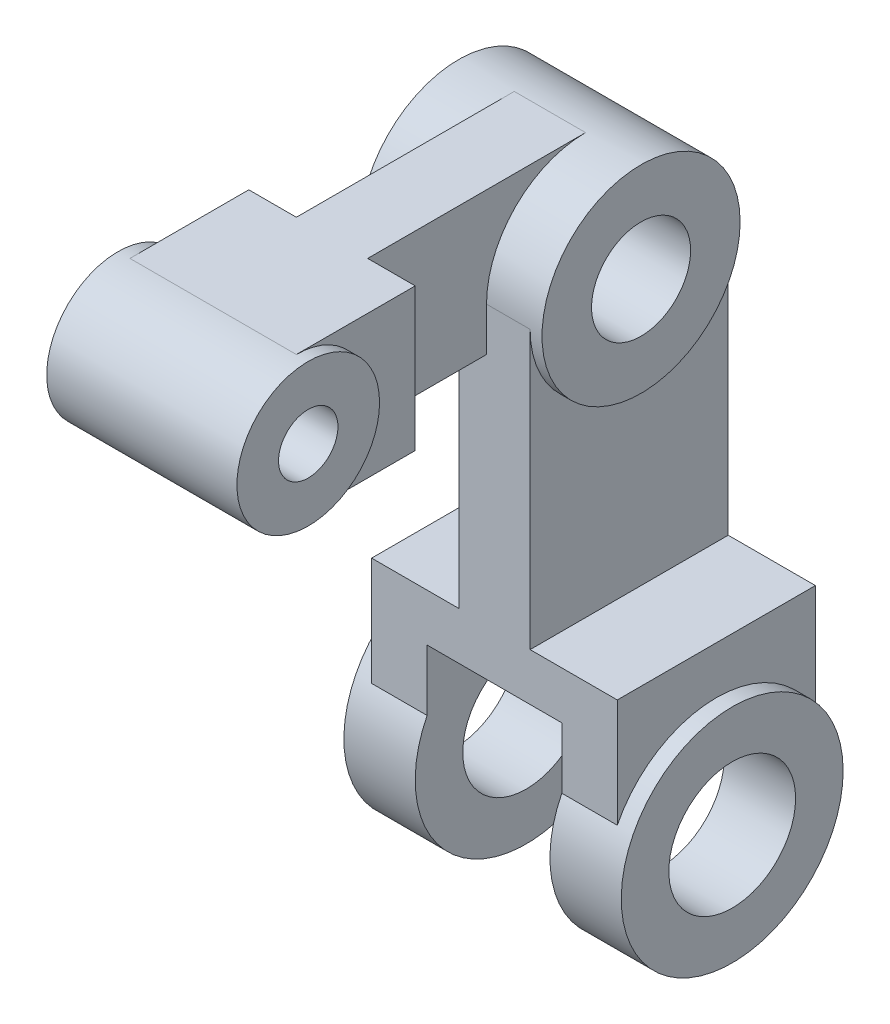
from build123d import *

# Parameters (mm, degrees)
SKETCH1_R                = 28
SKETCH1_R_2              = 16
BOSS_EXTRUDE1_DEPTH      = 35
BOSS_EXTRUDE2_DEPTH      = 31
BOSS_EXTRUDE3_DEPTH      = 9
BOSS_EXTRUDE4_DEPTH      = 12
BOSS_EXTRUDE4_DEPTH_BACK = 34
SKETCH3_10_R             = 25
SKETCH3_10_R_2           = 12.5
CUT_EXTRUDE1_DEPTH       = 143.246265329
CUT_EXTRUDE1_DEPTH_BACK  = 143.246265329
SKETCH5_W                = 34
SKETCH5_H                = 56
BOSS_EXTRUDE5_REACH      = 164.293
SKETCH7_W                = 18
SKETCH7_H                = 36
BOSS_EXTRUDE6_DEPTH      = 21
SKETCH8_4_R              = 18
SKETCH8_4_R_2            = 7.5
BOSS_EXTRUDE7_DEPTH      = 24


with BuildPart() as part:
    # Sketch1 → Boss-Extrude1 (new, symmetric)
    with BuildSketch(Plane(origin=(0, 0, 0), x_dir=(0, 0, -1), z_dir=(1, 0, 0))):
        Circle(SKETCH1_R)
        Circle(SKETCH1_R_2, mode=Mode.SUBTRACT)
    extrude(amount=BOSS_EXTRUDE1_DEPTH, both=True)

    # Sketch2 → Boss-Extrude2 (add, symmetric)
    with BuildSketch(Plane(origin=(0, 0, 0), x_dir=(0, 0, -1), z_dir=(1, 0, 0))):
        with BuildLine():
            Line((-25, 40), (25, 40))
            Line((25, 40), (25, 12.609520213))
            ThreePointArc((25, 12.609520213), (0, 28), (-25, 12.609520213))
            Line((-25, 12.609520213), (-25, 40))
        make_face()
    extrude(amount=BOSS_EXTRUDE2_DEPTH, both=True)

    # Sketch3 → Boss-Extrude3 (add, symmetric)
    with BuildSketch(Plane(origin=(0, 0, 0), x_dir=(0, 0, -1), z_dir=(1, 0, 0))):
        with BuildLine():
            Line((-25, 110), (-25, 40))
            Line((-25, 40), (25, 40))
            Line((25, 40), (25, 110))
            ThreePointArc((25, 110), (0, 85), (-25, 110))
        make_face()
    extrude(amount=BOSS_EXTRUDE3_DEPTH, both=True)

    # Sketch3_10 → Boss-Extrude4 (add, two sides: drawn at the far end of the back side and taken through both)
    with BuildSketch(Plane(origin=(0, 0, 0), x_dir=(0, 0, -1), z_dir=(1, 0, 0)).offset(-BOSS_EXTRUDE4_DEPTH_BACK)):
        with Locations((0, 110)):
            Circle(SKETCH3_10_R)
        with Locations((0, 110)):
            Circle(SKETCH3_10_R_2, mode=Mode.SUBTRACT)
    extrude(amount=BOSS_EXTRUDE4_DEPTH + BOSS_EXTRUDE4_DEPTH_BACK)

    # Sketch5 → Cut-Extrude1 (cut, two sides: drawn at the far end of the back side and taken through both)
    with BuildSketch(Plane.XY.offset(-CUT_EXTRUDE1_DEPTH_BACK)):
        Rectangle(SKETCH5_W, SKETCH5_H)
    extrude(amount=CUT_EXTRUDE1_DEPTH + CUT_EXTRUDE1_DEPTH_BACK, mode=Mode.SUBTRACT)

    # Sketch7 → Boss-Extrude5 (add, up to next)
    with BuildSketch(Plane.XY.offset(55), mode=Mode.PRIVATE) as boss_extrude5_sk1:
        with Locations((-11, 117)):
            Rectangle(SKETCH7_W, SKETCH7_H)
    boss_extrude5_tool1 = extrude(boss_extrude5_sk1.sketch, amount=-BOSS_EXTRUDE5_REACH, mode=Mode.PRIVATE) - part.part
    add(boss_extrude5_tool1.solids().sort_by_distance((-11, 117, 55))[0])

    # Sketch8 → Boss-Extrude6 (add, symmetric)
    with BuildSketch(Plane(origin=(-11, 0, 0), x_dir=(0, 0, -1), z_dir=(1, 0, 0))):
        with BuildLine():
            Line((-55, 135), (-85, 135))
            ThreePointArc((-85, 135), (-72.272077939, 129.727922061), (-67, 117))
            ThreePointArc((-67, 117), (-72.272077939, 104.272077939), (-85, 99))
            Line((-85, 99), (-55, 99))
            Line((-55, 99), (-55, 135))
        make_face()
    extrude(amount=BOSS_EXTRUDE6_DEPTH, both=True)

    # Sketch8_4 → Boss-Extrude7 (add, symmetric)
    with BuildSketch(Plane(origin=(-11, 0, 0), x_dir=(0, 0, -1), z_dir=(1, 0, 0))):
        with Locations((-85, 117)):
            Circle(SKETCH8_4_R)
        with Locations((-85, 117)):
            Circle(SKETCH8_4_R_2, mode=Mode.SUBTRACT)
    extrude(amount=BOSS_EXTRUDE7_DEPTH, both=True)


solid = part.part
